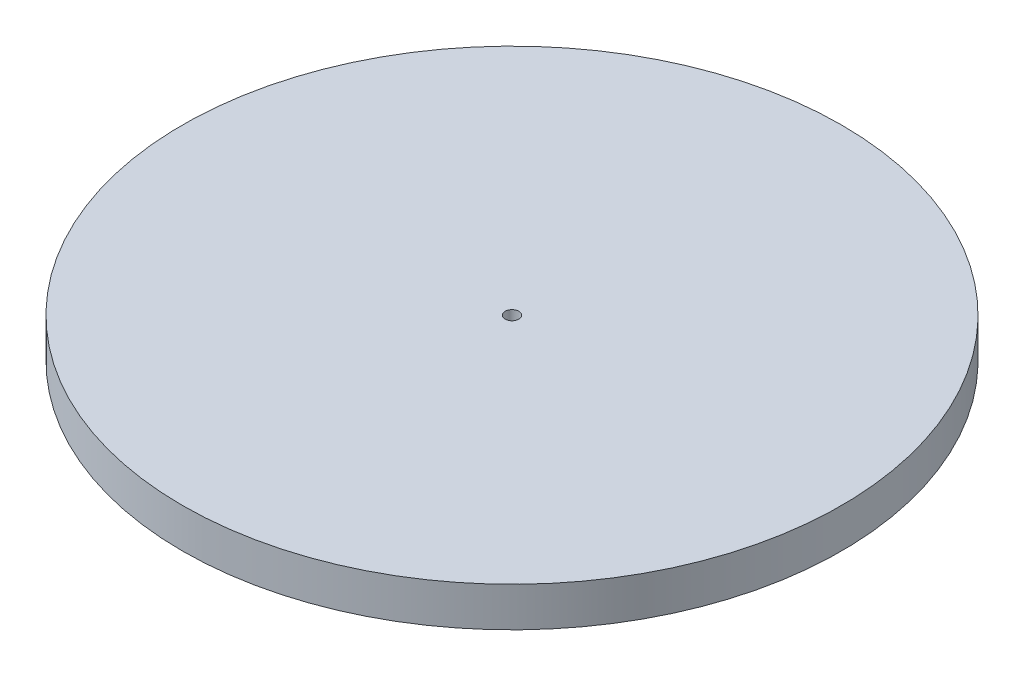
ISO-10303-21;
HEADER;
FILE_DESCRIPTION(('STEP AP214'),'2;1');
FILE_NAME('part.step','',(''),(''),'','','');
FILE_SCHEMA(('AUTOMOTIVE_DESIGN { 1 0 10303 214 1 1 1 1 }'));
ENDSEC;
DATA;
#1=APPLICATION_CONTEXT('core data for automotive mechanical design processes');
#2=APPLICATION_PROTOCOL_DEFINITION('international standard','automotive_design',2000,#1);
#3=PRODUCT_CONTEXT('',#1,'mechanical');
#4=PRODUCT('Part','Part','',(#3));
#5=PRODUCT_RELATED_PRODUCT_CATEGORY('part','',(#4));
#6=PRODUCT_DEFINITION_FORMATION('','',#4);
#7=PRODUCT_DEFINITION_CONTEXT('part definition',#1,'design');
#8=PRODUCT_DEFINITION('design','',#6,#7);
#9=PRODUCT_DEFINITION_SHAPE('','',#8);
#10=(LENGTH_UNIT() NAMED_UNIT(*) SI_UNIT(.MILLI.,.METRE.));
#11=(NAMED_UNIT(*) PLANE_ANGLE_UNIT() SI_UNIT($,.RADIAN.));
#12=(NAMED_UNIT(*) SI_UNIT($,.STERADIAN.) SOLID_ANGLE_UNIT());
#13=UNCERTAINTY_MEASURE_WITH_UNIT(LENGTH_MEASURE(1.E-05),#10,'distance_accuracy_value','');
#14=(GEOMETRIC_REPRESENTATION_CONTEXT(3) GLOBAL_UNCERTAINTY_ASSIGNED_CONTEXT((#13)) GLOBAL_UNIT_ASSIGNED_CONTEXT((#10,
#11,#12)) REPRESENTATION_CONTEXT('',''));
#15=CARTESIAN_POINT('',(0.,0.,0.));
#16=DIRECTION('',(0.,0.,1.));
#17=DIRECTION('',(1.,0.,0.));
#18=AXIS2_PLACEMENT_3D('',#15,#16,#17);
#19=CARTESIAN_POINT('',(0.,18.2562500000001,0.));
#20=DIRECTION('',(0.,1.,0.));
#21=DIRECTION('',(0.,0.,1.));
#22=AXIS2_PLACEMENT_3D('',#19,#20,#21);
#23=PLANE('',#22);
#24=CARTESIAN_POINT('',(0.,18.2562500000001,0.));
#25=DIRECTION('',(0.,1.,0.));
#26=DIRECTION('',(0.,0.,1.));
#27=AXIS2_PLACEMENT_3D('',#24,#25,#26);
#28=CIRCLE('',#27,152.4);
#29=CARTESIAN_POINT('',(-2.12819345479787E-13,18.2562500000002,152.400000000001));
#30=VERTEX_POINT('',#29);
#31=EDGE_CURVE('E10',#30,#30,#28,.T.);
#32=ORIENTED_EDGE('',*,*,#31,.T.);
#33=EDGE_LOOP('',(#32));
#34=FACE_BOUND('',#33,.T.);
#35=CARTESIAN_POINT('',(0.,18.2562500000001,0.));
#36=DIRECTION('',(0.,1.,0.));
#37=DIRECTION('',(0.,0.,1.));
#38=AXIS2_PLACEMENT_3D('',#35,#36,#37);
#39=CIRCLE('',#38,3.175);
#40=CARTESIAN_POINT('',(0.,18.2562500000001,3.17500000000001));
#41=VERTEX_POINT('',#40);
#42=EDGE_CURVE('E40',#41,#41,#39,.T.);
#43=ORIENTED_EDGE('',*,*,#42,.F.);
#44=EDGE_LOOP('',(#43));
#45=FACE_BOUND('',#44,.T.);
#46=ADVANCED_FACE('F29',(#34,#45),#23,.T.);
#47=CARTESIAN_POINT('',(0.,0.,0.));
#48=DIRECTION('',(0.,1.,0.));
#49=DIRECTION('',(0.,0.,1.));
#50=AXIS2_PLACEMENT_3D('',#47,#48,#49);
#51=PLANE('',#50);
#52=CARTESIAN_POINT('',(0.,0.,0.));
#53=DIRECTION('',(0.,1.,0.));
#54=DIRECTION('',(0.,0.,1.));
#55=AXIS2_PLACEMENT_3D('',#52,#53,#54);
#56=CIRCLE('',#55,152.4);
#57=CARTESIAN_POINT('',(-2.12819345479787E-13,1.26716696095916E-13,152.400000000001));
#58=VERTEX_POINT('',#57);
#59=EDGE_CURVE('E33',#58,#58,#56,.T.);
#60=ORIENTED_EDGE('',*,*,#59,.F.);
#61=EDGE_LOOP('',(#60));
#62=FACE_BOUND('',#61,.T.);
#63=CARTESIAN_POINT('',(0.,0.,0.));
#64=DIRECTION('',(0.,1.,0.));
#65=DIRECTION('',(0.,0.,1.));
#66=AXIS2_PLACEMENT_3D('',#63,#64,#65);
#67=CIRCLE('',#66,3.175);
#68=CARTESIAN_POINT('',(0.,0.,3.17500000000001));
#69=VERTEX_POINT('',#68);
#70=EDGE_CURVE('E42',#69,#69,#67,.T.);
#71=ORIENTED_EDGE('',*,*,#70,.T.);
#72=EDGE_LOOP('',(#71));
#73=FACE_BOUND('',#72,.T.);
#74=ADVANCED_FACE('F52',(#62,#73),#51,.F.);
#75=CARTESIAN_POINT('',(0.,18.2562500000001,0.));
#76=DIRECTION('',(0.,-1.,0.));
#77=DIRECTION('',(0.,0.,-1.));
#78=AXIS2_PLACEMENT_3D('',#75,#76,#77);
#79=CYLINDRICAL_SURFACE('',#78,152.4);
#80=ORIENTED_EDGE('',*,*,#31,.F.);
#81=EDGE_LOOP('',(#80));
#82=FACE_BOUND('',#81,.T.);
#83=ORIENTED_EDGE('',*,*,#59,.T.);
#84=EDGE_LOOP('',(#83));
#85=FACE_BOUND('',#84,.T.);
#86=ADVANCED_FACE('F31',(#82,#85),#79,.T.);
#87=CARTESIAN_POINT('',(0.,18.2562500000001,0.));
#88=DIRECTION('',(0.,-1.,0.));
#89=DIRECTION('',(0.,0.,-1.));
#90=AXIS2_PLACEMENT_3D('',#87,#88,#89);
#91=CYLINDRICAL_SURFACE('',#90,3.175);
#92=ORIENTED_EDGE('',*,*,#42,.T.);
#93=EDGE_LOOP('',(#92));
#94=FACE_BOUND('',#93,.T.);
#95=ORIENTED_EDGE('',*,*,#70,.F.);
#96=EDGE_LOOP('',(#95));
#97=FACE_BOUND('',#96,.T.);
#98=ADVANCED_FACE('F48',(#94,#97),#91,.F.);
#99=CLOSED_SHELL('',(#46,#74,#86,#98));
#100=MANIFOLD_SOLID_BREP('B2',#99);
#101=ADVANCED_BREP_SHAPE_REPRESENTATION('',(#18,#100),#14);
#102=SHAPE_DEFINITION_REPRESENTATION(#9,#101);
ENDSEC;
END-ISO-10303-21;
